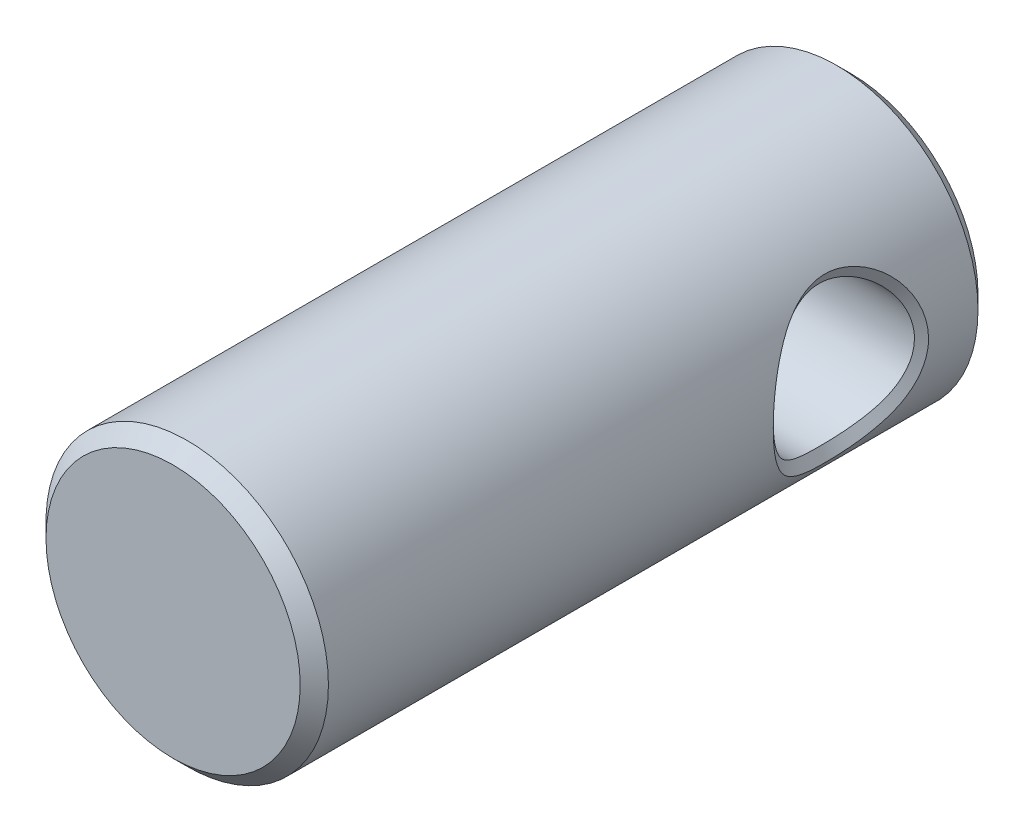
ISO-10303-21;
HEADER;
FILE_DESCRIPTION(('STEP AP214'),'2;1');
FILE_NAME('part.step','',(''),(''),'','','');
FILE_SCHEMA(('AUTOMOTIVE_DESIGN { 1 0 10303 214 1 1 1 1 }'));
ENDSEC;
DATA;
#1=APPLICATION_CONTEXT('core data for automotive mechanical design processes');
#2=APPLICATION_PROTOCOL_DEFINITION('international standard','automotive_design',2000,#1);
#3=PRODUCT_CONTEXT('',#1,'mechanical');
#4=PRODUCT('Part','Part','',(#3));
#5=PRODUCT_RELATED_PRODUCT_CATEGORY('part','',(#4));
#6=PRODUCT_DEFINITION_FORMATION('','',#4);
#7=PRODUCT_DEFINITION_CONTEXT('part definition',#1,'design');
#8=PRODUCT_DEFINITION('design','',#6,#7);
#9=PRODUCT_DEFINITION_SHAPE('','',#8);
#10=(LENGTH_UNIT() NAMED_UNIT(*) SI_UNIT(.MILLI.,.METRE.));
#11=(NAMED_UNIT(*) PLANE_ANGLE_UNIT() SI_UNIT($,.RADIAN.));
#12=(NAMED_UNIT(*) SI_UNIT($,.STERADIAN.) SOLID_ANGLE_UNIT());
#13=UNCERTAINTY_MEASURE_WITH_UNIT(LENGTH_MEASURE(1.E-05),#10,'distance_accuracy_value','');
#14=(GEOMETRIC_REPRESENTATION_CONTEXT(3) GLOBAL_UNCERTAINTY_ASSIGNED_CONTEXT((#13)) GLOBAL_UNIT_ASSIGNED_CONTEXT((#10,
#11,#12)) REPRESENTATION_CONTEXT('',''));
#15=CARTESIAN_POINT('',(0.,0.,0.));
#16=DIRECTION('',(0.,0.,1.));
#17=DIRECTION('',(1.,0.,0.));
#18=AXIS2_PLACEMENT_3D('',#15,#16,#17);
#19=CARTESIAN_POINT('',(0.,0.,48.));
#20=DIRECTION('',(0.,0.,-1.));
#21=DIRECTION('',(-1.,0.,0.));
#22=AXIS2_PLACEMENT_3D('',#19,#20,#21);
#23=CYLINDRICAL_SURFACE('',#22,10.);
#24=CARTESIAN_POINT('',(-10.,0.,15.499995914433));
#25=CARTESIAN_POINT('',(-10.0000070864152,0.0974069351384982,15.5000148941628));
#26=CARTESIAN_POINT('',(-9.99843697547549,0.194806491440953,15.4976010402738));
#27=CARTESIAN_POINT('',(-9.99229133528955,0.38888267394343,15.4880078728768));
#28=CARTESIAN_POINT('',(-9.98772794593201,0.485560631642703,15.4808478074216));
#29=CARTESIAN_POINT('',(-9.97575963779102,0.678000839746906,15.4618882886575));
#30=CARTESIAN_POINT('',(-9.9683628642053,0.773764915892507,15.450102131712));
#31=CARTESIAN_POINT('',(-9.95089545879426,0.964191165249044,15.4220219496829));
#32=CARTESIAN_POINT('',(-9.94083002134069,1.05885511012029,15.4057366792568));
#33=CARTESIAN_POINT('',(-9.91819059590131,1.24689378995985,15.3687864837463));
#34=CARTESIAN_POINT('',(-9.90561976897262,1.34026999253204,15.3481270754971));
#35=CARTESIAN_POINT('',(-9.87813433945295,1.52554646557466,15.3025560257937));
#36=CARTESIAN_POINT('',(-9.86322161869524,1.61744785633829,15.2776477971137));
#37=CARTESIAN_POINT('',(-9.83121636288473,1.79958784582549,15.2237052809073));
#38=CARTESIAN_POINT('',(-9.81412502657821,1.88982732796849,15.1946732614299));
#39=CARTESIAN_POINT('',(-9.77792596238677,2.06845650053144,15.1326084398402));
#40=CARTESIAN_POINT('',(-9.75881919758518,2.15684705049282,15.0995775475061));
#41=CARTESIAN_POINT('',(-9.71875228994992,2.33159109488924,15.0296394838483));
#42=CARTESIAN_POINT('',(-9.69779318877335,2.41794570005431,14.992734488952));
#43=CARTESIAN_POINT('',(-9.6541842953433,2.58843026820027,14.9151721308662));
#44=CARTESIAN_POINT('',(-9.63153582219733,2.67256189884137,14.874517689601));
#45=CARTESIAN_POINT('',(-9.58471085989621,2.83841264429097,14.7895798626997));
#46=CARTESIAN_POINT('',(-9.56053606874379,2.9201342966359,14.7453004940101));
#47=CARTESIAN_POINT('',(-9.51082045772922,3.08097669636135,14.6532359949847));
#48=CARTESIAN_POINT('',(-9.48528173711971,3.16010115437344,14.6054562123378));
#49=CARTESIAN_POINT('',(-9.43300250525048,3.31556112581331,14.506513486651));
#50=CARTESIAN_POINT('',(-9.4062644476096,3.39190180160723,14.4553573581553));
#51=CARTESIAN_POINT('',(-9.35174243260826,3.54160338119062,14.3497857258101));
#52=CARTESIAN_POINT('',(-9.32396120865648,3.61497115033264,14.2953785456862));
#53=CARTESIAN_POINT('',(-9.26754009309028,3.75854510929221,14.1834236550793));
#54=CARTESIAN_POINT('',(-9.23890299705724,3.82876004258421,14.1258857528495));
#55=CARTESIAN_POINT('',(-9.1808414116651,3.96581184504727,14.0078064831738));
#56=CARTESIAN_POINT('',(-9.15141999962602,4.03265959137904,13.9472762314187));
#57=CARTESIAN_POINT('',(-9.09221678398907,4.16305469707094,13.8231235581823));
#58=CARTESIAN_POINT('',(-9.06243553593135,4.22660649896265,13.7595055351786));
#59=CARTESIAN_POINT('',(-9.00302799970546,4.35056812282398,13.6291413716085));
#60=CARTESIAN_POINT('',(-8.97340179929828,4.41097630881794,13.5623936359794));
#61=CARTESIAN_POINT('',(-8.9144674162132,4.52849089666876,13.425949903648));
#62=CARTESIAN_POINT('',(-8.88515915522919,4.58559812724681,13.3562546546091));
#63=CARTESIAN_POINT('',(-8.8271391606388,4.69638539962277,13.2140773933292));
#64=CARTESIAN_POINT('',(-8.7984268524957,4.750068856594,13.1415982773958));
#65=CARTESIAN_POINT('',(-8.74184676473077,4.85387377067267,12.9940199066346));
#66=CARTESIAN_POINT('',(-8.71397760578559,4.9040012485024,12.9189254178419));
#67=CARTESIAN_POINT('',(-8.65934041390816,5.00056185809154,12.7662818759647));
#68=CARTESIAN_POINT('',(-8.63256991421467,5.04700351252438,12.688739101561));
#69=CARTESIAN_POINT('',(-8.58038468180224,5.13605957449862,12.5313652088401));
#70=CARTESIAN_POINT('',(-8.55496621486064,5.17868477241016,12.4515414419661));
#71=CARTESIAN_POINT('',(-8.5057404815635,5.25997539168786,12.289772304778));
#72=CARTESIAN_POINT('',(-8.48192815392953,5.29865346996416,12.2078348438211));
#73=CARTESIAN_POINT('',(-8.43616989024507,5.3719178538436,12.0420048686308));
#74=CARTESIAN_POINT('',(-8.4142176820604,5.40651807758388,11.9581202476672));
#75=CARTESIAN_POINT('',(-8.37243517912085,5.47149476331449,11.7885657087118));
#76=CARTESIAN_POINT('',(-8.35259774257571,5.50188555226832,11.7029030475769));
#77=CARTESIAN_POINT('',(-8.31529826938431,5.55831460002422,11.5299529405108));
#78=CARTESIAN_POINT('',(-8.29782885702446,5.58436643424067,11.4426715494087));
#79=CARTESIAN_POINT('',(-8.27358485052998,5.62010055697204,11.3105942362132));
#80=CARTESIAN_POINT('',(-8.26583673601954,5.63144531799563,11.2664191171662));
#81=CARTESIAN_POINT('',(-8.25102870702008,5.65299982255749,11.1777280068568));
#82=CARTESIAN_POINT('',(-8.24396806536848,5.66321076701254,11.133212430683));
#83=CARTESIAN_POINT('',(-8.23056696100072,5.68248103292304,11.0438631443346));
#84=CARTESIAN_POINT('',(-8.22422592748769,5.69154126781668,10.9990297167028));
#85=CARTESIAN_POINT('',(-8.21229553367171,5.70849424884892,10.9090654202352));
#86=CARTESIAN_POINT('',(-8.20670581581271,5.71638755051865,10.8639347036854));
#87=CARTESIAN_POINT('',(-8.19630960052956,5.73099069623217,10.7733970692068));
#88=CARTESIAN_POINT('',(-8.19150302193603,5.73770066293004,10.7279901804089));
#89=CARTESIAN_POINT('',(-8.18270455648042,5.74992126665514,10.6369212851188));
#90=CARTESIAN_POINT('',(-8.17871293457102,5.75543151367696,10.5912592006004));
#91=CARTESIAN_POINT('',(-8.17157571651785,5.76523697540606,10.4997010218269));
#92=CARTESIAN_POINT('',(-8.16843080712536,5.76953120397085,10.4538047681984));
#93=CARTESIAN_POINT('',(-8.16301854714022,5.7768886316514,10.3617993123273));
#94=CARTESIAN_POINT('',(-8.16075238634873,5.77995016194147,10.3156899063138));
#95=CARTESIAN_POINT('',(-8.15712803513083,5.78482770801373,10.2232792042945));
#96=CARTESIAN_POINT('',(-8.15577162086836,5.78664128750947,10.1769777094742));
#97=CARTESIAN_POINT('',(-8.15400098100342,5.78900319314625,10.084203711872));
#98=CARTESIAN_POINT('',(-8.15358921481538,5.7895482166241,10.0377310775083));
#99=CARTESIAN_POINT('',(-8.15372716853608,5.78937368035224,9.94480553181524));
#100=CARTESIAN_POINT('',(-8.15427656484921,5.78865454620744,9.89835261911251));
#101=CARTESIAN_POINT('',(-8.15630034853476,5.78597468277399,9.8056549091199));
#102=CARTESIAN_POINT('',(-8.15777171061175,5.78401801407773,9.75940992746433));
#103=CARTESIAN_POINT('',(-8.16161088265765,5.77887481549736,9.66714665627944));
#104=CARTESIAN_POINT('',(-8.16397635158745,5.77569149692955,9.62112808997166));
#105=CARTESIAN_POINT('',(-8.169571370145,5.76811202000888,9.52933614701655));
#106=CARTESIAN_POINT('',(-8.17279919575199,5.76371828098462,9.48356246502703));
#107=CARTESIAN_POINT('',(-8.18008768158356,5.75373347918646,9.39227872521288));
#108=CARTESIAN_POINT('',(-8.18414715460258,5.74814412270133,9.34676838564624));
#109=CARTESIAN_POINT('',(-8.1930674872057,5.73578390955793,9.25602972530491));
#110=CARTESIAN_POINT('',(-8.1979276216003,5.72901412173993,9.21080118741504));
#111=CARTESIAN_POINT('',(-8.20841798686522,5.71430867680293,9.12064444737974));
#112=CARTESIAN_POINT('',(-8.21404788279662,5.7063735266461,9.07571612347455));
#113=CARTESIAN_POINT('',(-8.22604650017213,5.68935298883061,8.98617824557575));
#114=CARTESIAN_POINT('',(-8.23241520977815,5.68026761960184,8.94156868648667));
#115=CARTESIAN_POINT('',(-8.24586037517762,5.66096200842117,8.8526862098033));
#116=CARTESIAN_POINT('',(-8.25293708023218,5.65074136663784,8.80841341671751));
#117=CARTESIAN_POINT('',(-8.26776676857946,5.62918120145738,8.72022436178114));
#118=CARTESIAN_POINT('',(-8.27552020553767,5.61784092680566,8.67630836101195));
#119=CARTESIAN_POINT('',(-8.29976211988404,5.58214440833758,8.54504975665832));
#120=CARTESIAN_POINT('',(-8.31721256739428,5.55614049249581,8.45832523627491));
#121=CARTESIAN_POINT('',(-8.35444324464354,5.49984615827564,8.28652429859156));
#122=CARTESIAN_POINT('',(-8.37422973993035,5.46954416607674,8.20145306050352));
#123=CARTESIAN_POINT('',(-8.41588584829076,5.40477494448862,8.03309606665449));
#124=CARTESIAN_POINT('',(-8.43776209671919,5.37029434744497,7.94981710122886));
#125=CARTESIAN_POINT('',(-8.48335043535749,5.29728998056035,7.78519214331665));
#126=CARTESIAN_POINT('',(-8.50706877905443,5.25875226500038,7.70385408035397));
#127=CARTESIAN_POINT('',(-8.55609515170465,5.17775398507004,7.54325638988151));
#128=CARTESIAN_POINT('',(-8.5814085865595,5.13527982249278,7.46400528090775));
#129=CARTESIAN_POINT('',(-8.63337911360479,5.04652820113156,7.307728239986));
#130=CARTESIAN_POINT('',(-8.66004052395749,5.00023817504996,7.2307108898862));
#131=CARTESIAN_POINT('',(-8.71446173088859,4.90397392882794,7.07904849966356));
#132=CARTESIAN_POINT('',(-8.74222469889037,4.85398865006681,7.00441162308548));
#133=CARTESIAN_POINT('',(-8.79860168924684,4.75045169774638,6.8576577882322));
#134=CARTESIAN_POINT('',(-8.82721780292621,4.69689077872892,6.78554816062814));
#135=CARTESIAN_POINT('',(-8.88506137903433,4.58632332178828,6.64399713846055));
#136=CARTESIAN_POINT('',(-8.91429003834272,4.52930952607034,6.57456190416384));
#137=CARTESIAN_POINT('',(-8.97308984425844,4.4119447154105,6.43850724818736));
#138=CARTESIAN_POINT('',(-9.00266146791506,4.35158845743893,6.37189255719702));
#139=CARTESIAN_POINT('',(-9.06198646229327,4.22769281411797,6.24163090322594));
#140=CARTESIAN_POINT('',(-9.09173998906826,4.16415020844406,6.17798707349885));
#141=CARTESIAN_POINT('',(-9.15091370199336,4.03375252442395,6.05369678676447));
#142=CARTESIAN_POINT('',(-9.18033301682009,3.96689050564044,5.99305718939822));
#143=CARTESIAN_POINT('',(-9.23840609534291,3.82980320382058,5.87477571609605));
#144=CARTESIAN_POINT('',(-9.26705687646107,3.7595671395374,5.81714487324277));
#145=CARTESIAN_POINT('',(-9.32351390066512,3.61594804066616,5.7050096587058));
#146=CARTESIAN_POINT('',(-9.35131738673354,3.54255628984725,5.65051506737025));
#147=CARTESIAN_POINT('',(-9.40589156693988,3.3927970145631,5.5447779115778));
#148=CARTESIAN_POINT('',(-9.43265952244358,3.31642254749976,5.49354376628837));
#149=CARTESIAN_POINT('',(-9.48500362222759,3.16088135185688,5.39445406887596));
#150=CARTESIAN_POINT('',(-9.51057724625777,3.08170928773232,5.34660556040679));
#151=CARTESIAN_POINT('',(-9.56036563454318,2.92075333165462,5.2544134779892));
#152=CARTESIAN_POINT('',(-9.58457815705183,2.83896546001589,5.21007563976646));
#153=CARTESIAN_POINT('',(-9.6314793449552,2.67295944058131,5.12503123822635));
#154=CARTESIAN_POINT('',(-9.65416607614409,2.58873839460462,5.08432926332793));
#155=CARTESIAN_POINT('',(-9.6978500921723,2.41804760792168,5.0066827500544));
#156=CARTESIAN_POINT('',(-9.71884570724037,2.33157575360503,4.96974191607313));
#157=CARTESIAN_POINT('',(-9.75898210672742,2.15656528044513,4.89974358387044));
#158=CARTESIAN_POINT('',(-9.77812136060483,2.06802502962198,4.8666892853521));
#159=CARTESIAN_POINT('',(-9.81437974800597,1.8890599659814,4.80458953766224));
#160=CARTESIAN_POINT('',(-9.83149726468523,1.79863371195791,4.77554729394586));
#161=CARTESIAN_POINT('',(-9.8635471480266,1.61607912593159,4.72159664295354));
#162=CARTESIAN_POINT('',(-9.87847746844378,1.5239492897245,4.69669210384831));
#163=CARTESIAN_POINT('',(-9.90598826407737,1.3381702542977,4.65114120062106));
#164=CARTESIAN_POINT('',(-9.91856578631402,1.2445193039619,4.63050018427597));
#165=CARTESIAN_POINT('',(-9.94120689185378,1.0558809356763,4.59359974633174));
#166=CARTESIAN_POINT('',(-9.95126599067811,0.96089144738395,4.57734813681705));
#167=CARTESIAN_POINT('',(-9.96870643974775,0.769758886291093,4.54934924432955));
#168=CARTESIAN_POINT('',(-9.97608099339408,0.67361351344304,4.53761338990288));
#169=CARTESIAN_POINT('',(-9.98799073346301,0.480352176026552,4.51876638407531));
#170=CARTESIAN_POINT('',(-9.99251588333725,0.383233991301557,4.51167157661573));
#171=CARTESIAN_POINT('',(-9.99856097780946,0.188208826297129,4.50223016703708));
#172=CARTESIAN_POINT('',(-10.000066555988,0.0903002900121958,4.49990626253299));
#173=CARTESIAN_POINT('',(-9.99992768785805,-0.105471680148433,4.50011135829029));
#174=CARTESIAN_POINT('',(-9.99828444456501,-0.203335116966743,4.50263850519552));
#175=CARTESIAN_POINT('',(-9.99199182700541,-0.398188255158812,4.51246220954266));
#176=CARTESIAN_POINT('',(-9.98735886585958,-0.495179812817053,4.51973272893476));
#177=CARTESIAN_POINT('',(-9.97525178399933,-0.68811629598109,4.53891346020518));
#178=CARTESIAN_POINT('',(-9.96778948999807,-0.784063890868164,4.55080436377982));
#179=CARTESIAN_POINT('',(-9.95019270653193,-0.974739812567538,4.57909322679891));
#180=CARTESIAN_POINT('',(-9.94006648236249,-1.06947097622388,4.59547725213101));
#181=CARTESIAN_POINT('',(-9.9173083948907,-1.25754213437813,4.63262228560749));
#182=CARTESIAN_POINT('',(-9.90468217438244,-1.35088476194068,4.65337344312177));
#183=CARTESIAN_POINT('',(-9.87709009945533,-1.53600719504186,4.6991236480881));
#184=CARTESIAN_POINT('',(-9.86212806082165,-1.62778928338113,4.72411577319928));
#185=CARTESIAN_POINT('',(-9.83002949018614,-1.80961907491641,4.77822004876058));
#186=CARTESIAN_POINT('',(-9.81289559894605,-1.89966873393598,4.80732720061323));
#187=CARTESIAN_POINT('',(-9.77661786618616,-2.07786201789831,4.86953462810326));
#188=CARTESIAN_POINT('',(-9.75747600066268,-2.16600741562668,4.90263098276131));
#189=CARTESIAN_POINT('',(-9.71734638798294,-2.3402203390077,4.97269074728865));
#190=CARTESIAN_POINT('',(-9.69636033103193,-2.42628967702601,5.00965062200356));
#191=CARTESIAN_POINT('',(-9.65270601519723,-2.59617837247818,5.087312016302));
#192=CARTESIAN_POINT('',(-9.63003942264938,-2.67999984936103,5.12800983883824));
#193=CARTESIAN_POINT('',(-9.58318763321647,-2.84522044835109,5.21302228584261));
#194=CARTESIAN_POINT('',(-9.55900423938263,-2.92662228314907,5.25733263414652));
#195=CARTESIAN_POINT('',(-9.50928173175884,-3.08683079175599,5.3494455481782));
#196=CARTESIAN_POINT('',(-9.48374463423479,-3.16564105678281,5.39724295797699));
#197=CARTESIAN_POINT('',(-9.4314796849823,-3.32049376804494,5.4962062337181));
#198=CARTESIAN_POINT('',(-9.40475406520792,-3.39654095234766,5.54736586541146));
#199=CARTESIAN_POINT('',(-9.35026908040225,-3.54569287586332,5.65292802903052));
#200=CARTESIAN_POINT('',(-9.32251212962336,-3.61880374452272,5.70732314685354));
#201=CARTESIAN_POINT('',(-9.26615117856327,-3.76191442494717,5.8192382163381));
#202=CARTESIAN_POINT('',(-9.23754960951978,-3.83192194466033,5.87674953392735));
#203=CARTESIAN_POINT('',(-9.17957606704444,-3.96863380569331,5.99475149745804));
#204=CARTESIAN_POINT('',(-9.15020673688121,-4.03534765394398,6.05523242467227));
#205=CARTESIAN_POINT('',(-9.09111734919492,-4.16551258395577,6.17926932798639));
#206=CARTESIAN_POINT('',(-9.06139777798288,-4.22896765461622,6.24282135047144));
#207=CARTESIAN_POINT('',(-9.0021136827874,-4.35272120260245,6.37304683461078));
#208=CARTESIAN_POINT('',(-8.97254922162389,-4.41301847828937,6.43972146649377));
#209=CARTESIAN_POINT('',(-8.91374114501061,-4.53030858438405,6.57600613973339));
#210=CARTESIAN_POINT('',(-8.88449741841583,-4.5873025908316,6.64561512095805));
#211=CARTESIAN_POINT('',(-8.82660636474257,-4.69786134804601,6.78760978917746));
#212=CARTESIAN_POINT('',(-8.79795842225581,-4.7514297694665,6.85999236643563));
#213=CARTESIAN_POINT('',(-8.74150549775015,-4.8550061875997,7.00736800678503));
#214=CARTESIAN_POINT('',(-8.71369910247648,-4.90502036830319,7.08235618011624));
#215=CARTESIAN_POINT('',(-8.65918400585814,-5.00135878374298,7.23477849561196));
#216=CARTESIAN_POINT('',(-8.63247282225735,-5.04769161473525,7.31220631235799));
#217=CARTESIAN_POINT('',(-8.58040102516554,-5.13653747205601,7.46934259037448));
#218=CARTESIAN_POINT('',(-8.55503668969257,-5.17906127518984,7.54904371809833));
#219=CARTESIAN_POINT('',(-8.50591221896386,-5.26015952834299,7.71056083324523));
#220=CARTESIAN_POINT('',(-8.48214706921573,-5.29874654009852,7.79236897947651));
#221=CARTESIAN_POINT('',(-8.43647436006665,-5.37184220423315,7.9579345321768));
#222=CARTESIAN_POINT('',(-8.41456061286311,-5.40636460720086,8.04168414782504));
#223=CARTESIAN_POINT('',(-8.37284442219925,-5.47120204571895,8.21096387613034));
#224=CARTESIAN_POINT('',(-8.35303495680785,-5.50153118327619,8.29648685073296));
#225=CARTESIAN_POINT('',(-8.31577902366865,-5.55785626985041,8.46915370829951));
#226=CARTESIAN_POINT('',(-8.29832532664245,-5.58386553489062,8.55629165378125));
#227=CARTESIAN_POINT('',(-8.27409451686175,-5.61955210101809,8.68815013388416));
#228=CARTESIAN_POINT('',(-8.26634895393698,-5.6308839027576,8.73225256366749));
#229=CARTESIAN_POINT('',(-8.25154227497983,-5.6524183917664,8.82079774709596));
#230=CARTESIAN_POINT('',(-8.24448045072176,-5.66262224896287,8.86524009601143));
#231=CARTESIAN_POINT('',(-8.23107300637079,-5.68188460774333,8.95444251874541));
#232=CARTESIAN_POINT('',(-8.2247268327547,-5.69094399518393,8.99920231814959));
#233=CARTESIAN_POINT('',(-8.21278196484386,-5.70790190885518,9.08901907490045));
#234=CARTESIAN_POINT('',(-8.20718292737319,-5.7158009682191,9.13407588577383));
#235=CARTESIAN_POINT('',(-8.19676366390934,-5.73042260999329,9.224465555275));
#236=CARTESIAN_POINT('',(-8.19194336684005,-5.73714529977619,9.26979838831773));
#237=CARTESIAN_POINT('',(-8.18311282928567,-5.74939870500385,9.36071914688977));
#238=CARTESIAN_POINT('',(-8.17910285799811,-5.75492902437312,9.40630715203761));
#239=CARTESIAN_POINT('',(-8.17192412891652,-5.76478226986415,9.49771727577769));
#240=CARTESIAN_POINT('',(-8.16875605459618,-5.76910421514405,9.54353955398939));
#241=CARTESIAN_POINT('',(-8.163292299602,-5.77652532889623,9.63539728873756));
#242=CARTESIAN_POINT('',(-8.16099779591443,-5.77962284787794,9.68143294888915));
#243=CARTESIAN_POINT('',(-8.15731190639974,-5.78457999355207,9.77369652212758));
#244=CARTESIAN_POINT('',(-8.15592227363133,-5.7864372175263,9.81992463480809));
#245=CARTESIAN_POINT('',(-8.15407817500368,-5.78889804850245,9.91255233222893));
#246=CARTESIAN_POINT('',(-8.153626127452,-5.78949841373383,9.95895205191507));
#247=CARTESIAN_POINT('',(-8.15368378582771,-5.78943259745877,10.051742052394));
#248=CARTESIAN_POINT('',(-8.15419332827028,-5.78876663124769,10.0981323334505));
#249=CARTESIAN_POINT('',(-8.15614446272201,-5.78617857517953,10.1907232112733));
#250=CARTESIAN_POINT('',(-8.15758334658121,-5.78426013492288,10.2369239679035));
#251=CARTESIAN_POINT('',(-8.16136228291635,-5.77918352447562,10.3291159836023));
#252=CARTESIAN_POINT('',(-8.16370030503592,-5.77602814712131,10.3751074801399));
#253=CARTESIAN_POINT('',(-8.16924531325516,-5.76849466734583,10.4668611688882));
#254=CARTESIAN_POINT('',(-8.17245086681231,-5.76411858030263,10.5126236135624));
#255=CARTESIAN_POINT('',(-8.17969919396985,-5.75416041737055,10.6038994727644));
#256=CARTESIAN_POINT('',(-8.18374105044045,-5.74857966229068,10.6494131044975));
#257=CARTESIAN_POINT('',(-8.19263021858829,-5.7362288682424,10.7401716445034));
#258=CARTESIAN_POINT('',(-8.1974770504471,-5.72945953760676,10.7854166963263));
#259=CARTESIAN_POINT('',(-8.20794451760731,-5.71474818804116,10.8756184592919));
#260=CARTESIAN_POINT('',(-8.21356503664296,-5.70680634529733,10.9205752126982));
#261=CARTESIAN_POINT('',(-8.22554826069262,-5.68976653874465,11.0101806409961));
#262=CARTESIAN_POINT('',(-8.23191114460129,-5.6806682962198,11.0548292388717));
#263=CARTESIAN_POINT('',(-8.2453476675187,-5.66133199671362,11.1437991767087));
#264=CARTESIAN_POINT('',(-8.25242171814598,-5.65109327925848,11.1881203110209));
#265=CARTESIAN_POINT('',(-8.26724876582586,-5.62949294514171,11.2764141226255));
#266=CARTESIAN_POINT('',(-8.27500235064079,-5.61813035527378,11.3203864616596));
#267=CARTESIAN_POINT('',(-8.29924987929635,-5.58235973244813,11.4518336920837));
#268=CARTESIAN_POINT('',(-8.31670782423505,-5.55630142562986,11.5386893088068));
#269=CARTESIAN_POINT('',(-8.35395950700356,-5.49989423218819,11.7107691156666));
#270=CARTESIAN_POINT('',(-8.37375995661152,-5.46953296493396,11.7959877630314));
#271=CARTESIAN_POINT('',(-8.41544737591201,-5.40464821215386,11.9646456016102));
#272=CARTESIAN_POINT('',(-8.43734108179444,-5.37011118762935,12.0480779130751));
#273=CARTESIAN_POINT('',(-8.48296504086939,-5.29700413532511,12.2130048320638));
#274=CARTESIAN_POINT('',(-8.506701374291,-5.25842059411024,12.2944917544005));
#275=CARTESIAN_POINT('',(-8.55576166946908,-5.17734801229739,12.4553716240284));
#276=CARTESIAN_POINT('',(-8.58109066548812,-5.13484636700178,12.5347566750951));
#277=CARTESIAN_POINT('',(-8.63308740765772,-5.04606435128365,12.6912752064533));
#278=CARTESIAN_POINT('',(-8.65975897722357,-4.99977292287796,12.7684011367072));
#279=CARTESIAN_POINT('',(-8.71419270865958,-4.90353772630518,12.9202434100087));
#280=CARTESIAN_POINT('',(-8.74195749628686,-4.85358488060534,12.9949530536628));
#281=CARTESIAN_POINT('',(-8.79832723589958,-4.75015190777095,13.1418042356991));
#282=CARTESIAN_POINT('',(-8.82693375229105,-4.69666494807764,13.2139403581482));
#283=CARTESIAN_POINT('',(-8.88474459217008,-4.58629206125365,13.3554852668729));
#284=CARTESIAN_POINT('',(-8.913949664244,-4.52940168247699,13.4248902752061));
#285=CARTESIAN_POINT('',(-8.97268416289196,-4.41233703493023,13.560814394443));
#286=CARTESIAN_POINT('',(-9.00221378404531,-4.3521606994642,13.6273316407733));
#287=CARTESIAN_POINT('',(-9.06143884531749,-4.22868820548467,13.757317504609));
#288=CARTESIAN_POINT('',(-9.09113427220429,-4.16539229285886,13.8207863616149));
#289=CARTESIAN_POINT('',(-9.15018665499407,-4.03547567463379,13.9447046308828));
#290=CARTESIAN_POINT('',(-9.17954277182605,-3.96884828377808,14.0051474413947));
#291=CARTESIAN_POINT('',(-9.23749927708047,-3.83215587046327,14.123085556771));
#292=CARTESIAN_POINT('',(-9.26609578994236,-3.76207706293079,14.1805667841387));
#293=CARTESIAN_POINT('',(-9.32245881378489,-3.61871316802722,14.292449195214));
#294=CARTESIAN_POINT('',(-9.35022177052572,-3.54541694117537,14.3468378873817));
#295=CARTESIAN_POINT('',(-9.40472743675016,-3.39580137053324,14.4524055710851));
#296=CARTESIAN_POINT('',(-9.43146662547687,-3.31947316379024,14.5035738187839));
#297=CARTESIAN_POINT('',(-9.48376553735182,-3.16398999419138,14.6025699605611));
#298=CARTESIAN_POINT('',(-9.50932204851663,-3.08482826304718,14.650388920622));
#299=CARTESIAN_POINT('',(-9.55908780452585,-2.92387111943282,14.7425559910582));
#300=CARTESIAN_POINT('',(-9.58329424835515,-2.84207074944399,14.7868969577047));
#301=CARTESIAN_POINT('',(-9.63019420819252,-2.6760306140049,14.8719775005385));
#302=CARTESIAN_POINT('',(-9.65288541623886,-2.59178739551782,14.9127116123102));
#303=CARTESIAN_POINT('',(-9.69658856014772,-2.42105589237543,14.9904480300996));
#304=CARTESIAN_POINT('',(-9.71759869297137,-2.33456532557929,15.0274463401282));
#305=CARTESIAN_POINT('',(-9.75777349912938,-2.15953384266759,15.0975809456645));
#306=CARTESIAN_POINT('',(-9.77693680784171,-2.07099146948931,15.1307143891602));
#307=CARTESIAN_POINT('',(-9.81325181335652,-1.892051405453,15.192989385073));
#308=CARTESIAN_POINT('',(-9.83040241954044,-1.80165273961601,15.2221287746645));
#309=CARTESIAN_POINT('',(-9.86252605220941,-1.61919544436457,15.2762862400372));
#310=CARTESIAN_POINT('',(-9.87749798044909,-1.52713600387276,15.3013022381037));
#311=CARTESIAN_POINT('',(-9.90509861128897,-1.34155284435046,15.3470841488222));
#312=CARTESIAN_POINT('',(-9.91772578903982,-1.24802821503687,15.3678472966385));
#313=CARTESIAN_POINT('',(-9.94047162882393,-1.05971048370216,15.4049953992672));
#314=CARTESIAN_POINT('',(-9.95058776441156,-0.964916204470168,15.4213759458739));
#315=CARTESIAN_POINT('',(-9.96814716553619,-0.774255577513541,15.449632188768));
#316=CARTESIAN_POINT('',(-9.97558615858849,-0.678387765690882,15.4615006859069));
#317=CARTESIAN_POINT('',(-9.98762645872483,-0.485774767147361,15.4806055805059));
#318=CARTESIAN_POINT('',(-9.99222082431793,-0.389028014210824,15.4878306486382));
#319=CARTESIAN_POINT('',(-9.99841265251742,-0.194857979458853,15.4975294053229));
#320=CARTESIAN_POINT('',(-9.99999943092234,-0.0974335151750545,15.4999861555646));
#321=CARTESIAN_POINT('',(-10.,0.,15.499995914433));
#322=B_SPLINE_CURVE_WITH_KNOTS('',3,(#24,#25,#26,#27,#28,#29,#30,#31,#32,#33,#34,#35,#36,#37,
#38,#39,#40,#41,#42,#43,#44,#45,#46,#47,#48,#49,#50,#51,#52,#53,#54,#55,#56,#57,#58,#59,#60,#61,
#62,#63,#64,#65,#66,#67,#68,#69,#70,#71,#72,#73,#74,#75,#76,#77,#78,#79,#80,#81,#82,#83,#84,#85,
#86,#87,#88,#89,#90,#91,#92,#93,#94,#95,#96,#97,#98,#99,#100,#101,#102,#103,#104,#105,#106,#107,
#108,#109,#110,#111,#112,#113,#114,#115,#116,#117,#118,#119,#120,#121,#122,#123,#124,#125,#126,
#127,#128,#129,#130,#131,#132,#133,#134,#135,#136,#137,#138,#139,#140,#141,#142,#143,#144,#145,
#146,#147,#148,#149,#150,#151,#152,#153,#154,#155,#156,#157,#158,#159,#160,#161,#162,#163,#164,
#165,#166,#167,#168,#169,#170,#171,#172,#173,#174,#175,#176,#177,#178,#179,#180,#181,#182,#183,
#184,#185,#186,#187,#188,#189,#190,#191,#192,#193,#194,#195,#196,#197,#198,#199,#200,#201,#202,
#203,#204,#205,#206,#207,#208,#209,#210,#211,#212,#213,#214,#215,#216,#217,#218,#219,#220,#221,
#222,#223,#224,#225,#226,#227,#228,#229,#230,#231,#232,#233,#234,#235,#236,#237,#238,#239,#240,
#241,#242,#243,#244,#245,#246,#247,#248,#249,#250,#251,#252,#253,#254,#255,#256,#257,#258,#259,
#260,#261,#262,#263,#264,#265,#266,#267,#268,#269,#270,#271,#272,#273,#274,#275,#276,#277,#278,
#279,#280,#281,#282,#283,#284,#285,#286,#287,#288,#289,#290,#291,#292,#293,#294,#295,#296,#297,
#298,#299,#300,#301,#302,#303,#304,#305,#306,#307,#308,#309,#310,#311,#312,#313,#314,#315,#316,
#317,#318,#319,#320,#321),.UNSPECIFIED.,.F.,.F.,(4,2,2,2,2,2,2,2,2,2,2,2,2,2,2,2,2,2,2,2,2,2,2,
2,2,2,2,2,2,2,2,2,2,2,2,2,2,2,2,2,2,2,2,2,2,2,2,2,2,2,2,2,2,2,2,2,2,2,2,2,2,2,2,2,2,2,2,2,2,2,2,
2,2,2,2,2,2,2,2,2,2,2,2,2,2,2,2,2,2,2,2,2,2,2,2,2,2,2,2,2,2,2,2,2,2,2,2,2,2,2,2,2,2,2,2,2,2,2,2,
2,2,2,2,2,2,2,2,2,2,2,2,2,2,2,2,2,2,2,2,2,2,2,2,2,2,2,2,2,4),(0.,0.292166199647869,
0.583154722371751,0.873312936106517,1.16291047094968,1.45214490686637,1.74114810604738,
2.02999296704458,2.31870042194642,2.60724654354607,2.89556967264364,3.18357751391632,
3.47115418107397,3.75816719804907,4.04447448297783,4.32993135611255,4.6143976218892,
4.89846992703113,5.18268861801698,5.46683564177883,5.75069465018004,6.03406097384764,
6.31675173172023,6.59861617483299,6.87954633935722,7.15948804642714,7.43845223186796,
7.71652651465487,7.85529605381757,7.99391717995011,8.13242757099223,8.27087180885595,
8.40930168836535,8.54777650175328,8.68636329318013,8.82513707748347,8.96418101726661,
9.10358655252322,9.24294516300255,9.38184886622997,9.52039136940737,9.65865894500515,
9.79673049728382,9.93467767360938,10.0725650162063,10.2104501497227,10.3483839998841,
10.4864110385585,10.7628639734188,11.0400759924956,11.3181994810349,11.597312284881,
11.877428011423,12.1585062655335,12.4404626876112,12.7231787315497,13.0065111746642,
13.2903013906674,13.5743844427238,13.8590887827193,14.1447727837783,14.4313041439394,
14.7185476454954,15.0063721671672,15.294657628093,15.5833019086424,15.8722277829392,
16.1613898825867,16.4507816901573,16.7404425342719,17.0304645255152,17.3209993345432,
17.6122646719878,17.9045502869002,18.1982232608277,18.4917840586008,18.7837468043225,
19.0745023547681,19.3643662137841,19.6535831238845,19.9423324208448,20.2307339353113,
20.5188542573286,20.8067132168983,21.0942904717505,21.3815321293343,21.6683573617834,
21.9546649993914,22.2403401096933,22.5252605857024,22.8093037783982,23.0929905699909,
23.3767845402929,23.6604768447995,23.9438598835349,24.2267371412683,24.5089331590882,
24.7903037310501,25.0707463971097,25.3502112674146,25.6287121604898,25.9063379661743,
26.0448886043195,26.1832941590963,26.3215919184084,26.4598259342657,26.5980473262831,
26.7363145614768,26.8746937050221,27.0132586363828,27.1520912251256,27.2912814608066,
27.430448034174,27.5692108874,27.7076622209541,27.845886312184,27.9839596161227,28.121950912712,
28.2599214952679,28.3979253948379,28.536009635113,28.6742145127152,28.9510876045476,
29.2287741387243,29.5073864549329,29.7869607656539,30.0674681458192,30.3488253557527,
30.6309053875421,30.9135476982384,31.1965681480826,31.4797687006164,31.762946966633,
32.0467182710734,32.3317331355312,32.6178275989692,32.9048307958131,33.1925724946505,
33.4808905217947,33.7696381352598,34.058691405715,34.3479566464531,34.6373779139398,
34.926944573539,35.2166988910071,35.5067435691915,35.7972491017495,36.0884607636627,
36.3807050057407),.UNSPECIFIED.);
#323=CARTESIAN_POINT('',(-10.,0.,15.499995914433));
#324=VERTEX_POINT('',#323);
#325=EDGE_CURVE('E43',#324,#324,#322,.F.);
#326=ORIENTED_EDGE('',*,*,#325,.T.);
#327=EDGE_LOOP('',(#326));
#328=FACE_BOUND('',#327,.T.);
#329=CARTESIAN_POINT('',(10.,0.,4.50000408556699));
#330=CARTESIAN_POINT('',(10.0000070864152,0.0974069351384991,4.49998510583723));
#331=CARTESIAN_POINT('',(9.9984369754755,0.194806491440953,4.50239895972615));
#332=CARTESIAN_POINT('',(9.99229133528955,0.388882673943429,4.5119921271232));
#333=CARTESIAN_POINT('',(9.98772794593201,0.485560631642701,4.51915219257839));
#334=CARTESIAN_POINT('',(9.97575963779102,0.678000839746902,4.53811171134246));
#335=CARTESIAN_POINT('',(9.9683628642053,0.7737649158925,4.54989786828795));
#336=CARTESIAN_POINT('',(9.95089545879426,0.964191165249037,4.57797805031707));
#337=CARTESIAN_POINT('',(9.94083002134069,1.05885511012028,4.59426332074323));
#338=CARTESIAN_POINT('',(9.91819059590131,1.24689378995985,4.63121351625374));
#339=CARTESIAN_POINT('',(9.90561976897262,1.34026999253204,4.65187292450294));
#340=CARTESIAN_POINT('',(9.87813433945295,1.52554646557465,4.69744397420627));
#341=CARTESIAN_POINT('',(9.86322161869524,1.61744785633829,4.72235220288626));
#342=CARTESIAN_POINT('',(9.83121636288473,1.79958784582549,4.77629471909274));
#343=CARTESIAN_POINT('',(9.81412502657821,1.88982732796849,4.80532673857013));
#344=CARTESIAN_POINT('',(9.77792596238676,2.06845650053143,4.86739156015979));
#345=CARTESIAN_POINT('',(9.75881919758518,2.15684705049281,4.90042245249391));
#346=CARTESIAN_POINT('',(9.71875228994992,2.33159109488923,4.9703605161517));
#347=CARTESIAN_POINT('',(9.69779318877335,2.4179457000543,5.00726551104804));
#348=CARTESIAN_POINT('',(9.6541842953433,2.58843026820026,5.0848278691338));
#349=CARTESIAN_POINT('',(9.63153582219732,2.67256189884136,5.12548231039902));
#350=CARTESIAN_POINT('',(9.58471085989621,2.83841264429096,5.21042013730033));
#351=CARTESIAN_POINT('',(9.56053606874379,2.9201342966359,5.25469950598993));
#352=CARTESIAN_POINT('',(9.51082045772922,3.08097669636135,5.34676400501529));
#353=CARTESIAN_POINT('',(9.4852817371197,3.16010115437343,5.3945437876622));
#354=CARTESIAN_POINT('',(9.43300250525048,3.31556112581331,5.49348651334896));
#355=CARTESIAN_POINT('',(9.4062644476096,3.39190180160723,5.54464264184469));
#356=CARTESIAN_POINT('',(9.35174243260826,3.54160338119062,5.65021427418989));
#357=CARTESIAN_POINT('',(9.32396120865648,3.61497115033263,5.70462145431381));
#358=CARTESIAN_POINT('',(9.26754009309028,3.7585451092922,5.81657634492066));
#359=CARTESIAN_POINT('',(9.23890299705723,3.82876004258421,5.87411424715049));
#360=CARTESIAN_POINT('',(9.1808414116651,3.96581184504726,5.99219351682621));
#361=CARTESIAN_POINT('',(9.15141999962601,4.03265959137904,6.0527237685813));
#362=CARTESIAN_POINT('',(9.09221678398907,4.16305469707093,6.17687644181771));
#363=CARTESIAN_POINT('',(9.06243553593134,4.22660649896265,6.24049446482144));
#364=CARTESIAN_POINT('',(9.00302799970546,4.35056812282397,6.37085862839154));
#365=CARTESIAN_POINT('',(8.97340179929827,4.41097630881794,6.43760636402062));
#366=CARTESIAN_POINT('',(8.9144674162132,4.52849089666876,6.57405009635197));
#367=CARTESIAN_POINT('',(8.88515915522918,4.5855981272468,6.64374534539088));
#368=CARTESIAN_POINT('',(8.8271391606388,4.69638539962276,6.7859226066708));
#369=CARTESIAN_POINT('',(8.79842685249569,4.750068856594,6.85840172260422));
#370=CARTESIAN_POINT('',(8.74184676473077,4.85387377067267,7.00598009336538));
#371=CARTESIAN_POINT('',(8.71397760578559,4.9040012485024,7.08107458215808));
#372=CARTESIAN_POINT('',(8.65934041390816,5.00056185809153,7.23371812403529));
#373=CARTESIAN_POINT('',(8.63256991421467,5.04700351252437,7.31126089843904));
#374=CARTESIAN_POINT('',(8.58038468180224,5.13605957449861,7.46863479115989));
#375=CARTESIAN_POINT('',(8.55496621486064,5.17868477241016,7.54845855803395));
#376=CARTESIAN_POINT('',(8.50574048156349,5.25997539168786,7.71022769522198));
#377=CARTESIAN_POINT('',(8.48192815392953,5.29865346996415,7.79216515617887));
#378=CARTESIAN_POINT('',(8.43616989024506,5.37191785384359,7.95799513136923));
#379=CARTESIAN_POINT('',(8.4142176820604,5.40651807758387,8.04187975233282));
#380=CARTESIAN_POINT('',(8.37243517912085,5.47149476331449,8.21143429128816));
#381=CARTESIAN_POINT('',(8.35259774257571,5.50188555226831,8.29709695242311));
#382=CARTESIAN_POINT('',(8.31529826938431,5.55831460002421,8.47004705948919));
#383=CARTESIAN_POINT('',(8.29782885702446,5.58436643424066,8.55732845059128));
#384=CARTESIAN_POINT('',(8.27358485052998,5.62010055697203,8.68940576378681));
#385=CARTESIAN_POINT('',(8.26583673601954,5.63144531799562,8.73358088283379));
#386=CARTESIAN_POINT('',(8.25102870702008,5.65299982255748,8.82227199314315));
#387=CARTESIAN_POINT('',(8.24396806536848,5.66321076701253,8.86678756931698));
#388=CARTESIAN_POINT('',(8.23056696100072,5.68248103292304,8.95613685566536));
#389=CARTESIAN_POINT('',(8.22422592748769,5.69154126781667,9.00097028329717));
#390=CARTESIAN_POINT('',(8.21229553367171,5.70849424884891,9.0909345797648));
#391=CARTESIAN_POINT('',(8.20670581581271,5.71638755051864,9.13606529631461));
#392=CARTESIAN_POINT('',(8.19630960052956,5.73099069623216,9.22660293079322));
#393=CARTESIAN_POINT('',(8.19150302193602,5.73770066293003,9.27200981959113));
#394=CARTESIAN_POINT('',(8.18270455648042,5.74992126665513,9.36307871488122));
#395=CARTESIAN_POINT('',(8.17871293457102,5.75543151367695,9.40874079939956));
#396=CARTESIAN_POINT('',(8.17157571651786,5.76523697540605,9.50029897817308));
#397=CARTESIAN_POINT('',(8.16843080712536,5.76953120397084,9.54619523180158));
#398=CARTESIAN_POINT('',(8.16301854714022,5.7768886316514,9.63820068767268));
#399=CARTESIAN_POINT('',(8.16075238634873,5.77995016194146,9.68431009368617));
#400=CARTESIAN_POINT('',(8.15712803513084,5.78482770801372,9.77672079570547));
#401=CARTESIAN_POINT('',(8.15577162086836,5.78664128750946,9.82302229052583));
#402=CARTESIAN_POINT('',(8.15400098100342,5.78900319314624,9.91579628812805));
#403=CARTESIAN_POINT('',(8.15358921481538,5.78954821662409,9.96226892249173));
#404=CARTESIAN_POINT('',(8.15372716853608,5.78937368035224,10.0551944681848));
#405=CARTESIAN_POINT('',(8.15427656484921,5.78865454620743,10.1016473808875));
#406=CARTESIAN_POINT('',(8.15630034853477,5.78597468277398,10.1943450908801));
#407=CARTESIAN_POINT('',(8.15777171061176,5.78401801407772,10.2405900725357));
#408=CARTESIAN_POINT('',(8.16161088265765,5.77887481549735,10.3328533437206));
#409=CARTESIAN_POINT('',(8.16397635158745,5.77569149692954,10.3788719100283));
#410=CARTESIAN_POINT('',(8.16957137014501,5.76811202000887,10.4706638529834));
#411=CARTESIAN_POINT('',(8.172799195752,5.76371828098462,10.516437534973));
#412=CARTESIAN_POINT('',(8.18008768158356,5.75373347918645,10.6077212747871));
#413=CARTESIAN_POINT('',(8.18414715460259,5.74814412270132,10.6532316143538));
#414=CARTESIAN_POINT('',(8.1930674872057,5.73578390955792,10.7439702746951));
#415=CARTESIAN_POINT('',(8.19792762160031,5.72901412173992,10.789198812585));
#416=CARTESIAN_POINT('',(8.20841798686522,5.71430867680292,10.8793555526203));
#417=CARTESIAN_POINT('',(8.21404788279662,5.70637352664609,10.9242838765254));
#418=CARTESIAN_POINT('',(8.22604650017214,5.6893529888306,11.0138217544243));
#419=CARTESIAN_POINT('',(8.23241520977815,5.68026761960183,11.0584313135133));
#420=CARTESIAN_POINT('',(8.24586037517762,5.66096200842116,11.1473137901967));
#421=CARTESIAN_POINT('',(8.25293708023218,5.65074136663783,11.1915865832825));
#422=CARTESIAN_POINT('',(8.26776676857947,5.62918120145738,11.2797756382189));
#423=CARTESIAN_POINT('',(8.27552020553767,5.61784092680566,11.323691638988));
#424=CARTESIAN_POINT('',(8.29976211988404,5.58214440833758,11.4549502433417));
#425=CARTESIAN_POINT('',(8.31721256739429,5.5561404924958,11.5416747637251));
#426=CARTESIAN_POINT('',(8.35444324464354,5.49984615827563,11.7134757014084));
#427=CARTESIAN_POINT('',(8.37422973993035,5.46954416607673,11.7985469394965));
#428=CARTESIAN_POINT('',(8.41588584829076,5.40477494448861,11.9669039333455));
#429=CARTESIAN_POINT('',(8.43776209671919,5.37029434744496,12.0501828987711));
#430=CARTESIAN_POINT('',(8.48335043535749,5.29728998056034,12.2148078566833));
#431=CARTESIAN_POINT('',(8.50706877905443,5.25875226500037,12.296145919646));
#432=CARTESIAN_POINT('',(8.55609515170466,5.17775398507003,12.4567436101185));
#433=CARTESIAN_POINT('',(8.5814085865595,5.13527982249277,12.5359947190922));
#434=CARTESIAN_POINT('',(8.63337911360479,5.04652820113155,12.692271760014));
#435=CARTESIAN_POINT('',(8.6600405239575,5.00023817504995,12.7692891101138));
#436=CARTESIAN_POINT('',(8.71446173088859,4.90397392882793,12.9209515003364));
#437=CARTESIAN_POINT('',(8.74222469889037,4.8539886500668,12.9955883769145));
#438=CARTESIAN_POINT('',(8.79860168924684,4.75045169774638,13.1423422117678));
#439=CARTESIAN_POINT('',(8.82721780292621,4.69689077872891,13.2144518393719));
#440=CARTESIAN_POINT('',(8.88506137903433,4.58632332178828,13.3560028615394));
#441=CARTESIAN_POINT('',(8.91429003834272,4.52930952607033,13.4254380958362));
#442=CARTESIAN_POINT('',(8.97308984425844,4.41194471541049,13.5614927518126));
#443=CARTESIAN_POINT('',(9.00266146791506,4.35158845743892,13.628107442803));
#444=CARTESIAN_POINT('',(9.06198646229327,4.22769281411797,13.7583690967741));
#445=CARTESIAN_POINT('',(9.09173998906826,4.16415020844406,13.8220129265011));
#446=CARTESIAN_POINT('',(9.15091370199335,4.03375252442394,13.9463032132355));
#447=CARTESIAN_POINT('',(9.18033301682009,3.96689050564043,14.0069428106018));
#448=CARTESIAN_POINT('',(9.23840609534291,3.82980320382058,14.1252242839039));
#449=CARTESIAN_POINT('',(9.26705687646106,3.7595671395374,14.1828551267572));
#450=CARTESIAN_POINT('',(9.32351390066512,3.61594804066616,14.2949903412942));
#451=CARTESIAN_POINT('',(9.35131738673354,3.54255628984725,14.3494849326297));
#452=CARTESIAN_POINT('',(9.40589156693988,3.3927970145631,14.4552220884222));
#453=CARTESIAN_POINT('',(9.43265952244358,3.31642254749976,14.5064562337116));
#454=CARTESIAN_POINT('',(9.48500362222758,3.16088135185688,14.605545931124));
#455=CARTESIAN_POINT('',(9.51057724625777,3.08170928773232,14.6533944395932));
#456=CARTESIAN_POINT('',(9.56036563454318,2.92075333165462,14.7455865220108));
#457=CARTESIAN_POINT('',(9.58457815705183,2.83896546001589,14.7899243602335));
#458=CARTESIAN_POINT('',(9.6314793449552,2.6729594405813,14.8749687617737));
#459=CARTESIAN_POINT('',(9.65416607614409,2.58873839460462,14.9156707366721));
#460=CARTESIAN_POINT('',(9.6978500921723,2.41804760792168,14.9933172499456));
#461=CARTESIAN_POINT('',(9.71884570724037,2.33157575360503,15.0302580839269));
#462=CARTESIAN_POINT('',(9.75898210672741,2.15656528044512,15.1002564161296));
#463=CARTESIAN_POINT('',(9.77812136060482,2.06802502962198,15.1333107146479));
#464=CARTESIAN_POINT('',(9.81437974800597,1.8890599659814,15.1954104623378));
#465=CARTESIAN_POINT('',(9.83149726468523,1.7986337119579,15.2244527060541));
#466=CARTESIAN_POINT('',(9.8635471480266,1.61607912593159,15.2784033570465));
#467=CARTESIAN_POINT('',(9.87847746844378,1.5239492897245,15.3033078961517));
#468=CARTESIAN_POINT('',(9.90598826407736,1.3381702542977,15.3488587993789));
#469=CARTESIAN_POINT('',(9.91856578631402,1.2445193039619,15.369499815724));
#470=CARTESIAN_POINT('',(9.94120689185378,1.05588093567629,15.4064002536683));
#471=CARTESIAN_POINT('',(9.95126599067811,0.96089144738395,15.422651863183));
#472=CARTESIAN_POINT('',(9.96870643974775,0.769758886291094,15.4506507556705));
#473=CARTESIAN_POINT('',(9.97608099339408,0.673613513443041,15.4623866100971));
#474=CARTESIAN_POINT('',(9.987990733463,0.480352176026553,15.4812336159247));
#475=CARTESIAN_POINT('',(9.99251588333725,0.383233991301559,15.4883284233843));
#476=CARTESIAN_POINT('',(9.99856097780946,0.188208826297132,15.4977698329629));
#477=CARTESIAN_POINT('',(10.000066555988,0.090300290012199,15.500093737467));
#478=CARTESIAN_POINT('',(9.99992768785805,-0.105471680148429,15.4998886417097));
#479=CARTESIAN_POINT('',(9.99828444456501,-0.203335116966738,15.4973614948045));
#480=CARTESIAN_POINT('',(9.99199182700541,-0.398188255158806,15.4875377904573));
#481=CARTESIAN_POINT('',(9.98735886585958,-0.495179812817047,15.4802672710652));
#482=CARTESIAN_POINT('',(9.97525178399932,-0.688116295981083,15.4610865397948));
#483=CARTESIAN_POINT('',(9.96778948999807,-0.784063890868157,15.4491956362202));
#484=CARTESIAN_POINT('',(9.95019270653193,-0.974739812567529,15.4209067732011));
#485=CARTESIAN_POINT('',(9.94006648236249,-1.06947097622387,15.404522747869));
#486=CARTESIAN_POINT('',(9.9173083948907,-1.25754213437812,15.3673777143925));
#487=CARTESIAN_POINT('',(9.90468217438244,-1.35088476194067,15.3466265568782));
#488=CARTESIAN_POINT('',(9.87709009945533,-1.53600719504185,15.3008763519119));
#489=CARTESIAN_POINT('',(9.86212806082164,-1.62778928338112,15.2758842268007));
#490=CARTESIAN_POINT('',(9.83002949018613,-1.8096190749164,15.2217799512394));
#491=CARTESIAN_POINT('',(9.81289559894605,-1.89966873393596,15.1926727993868));
#492=CARTESIAN_POINT('',(9.77661786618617,-2.0778620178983,15.1304653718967));
#493=CARTESIAN_POINT('',(9.75747600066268,-2.16600741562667,15.0973690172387));
#494=CARTESIAN_POINT('',(9.71734638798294,-2.3402203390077,15.0273092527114));
#495=CARTESIAN_POINT('',(9.69636033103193,-2.426289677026,14.9903493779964));
#496=CARTESIAN_POINT('',(9.65270601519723,-2.59617837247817,14.912687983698));
#497=CARTESIAN_POINT('',(9.63003942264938,-2.67999984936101,14.8719901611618));
#498=CARTESIAN_POINT('',(9.58318763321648,-2.84522044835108,14.7869777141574));
#499=CARTESIAN_POINT('',(9.55900423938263,-2.92662228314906,14.7426673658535));
#500=CARTESIAN_POINT('',(9.50928173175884,-3.08683079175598,14.6505544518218));
#501=CARTESIAN_POINT('',(9.48374463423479,-3.1656410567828,14.602757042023));
#502=CARTESIAN_POINT('',(9.43147968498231,-3.32049376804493,14.5037937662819));
#503=CARTESIAN_POINT('',(9.40475406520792,-3.39654095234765,14.4526341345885));
#504=CARTESIAN_POINT('',(9.35026908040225,-3.54569287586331,14.3470719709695));
#505=CARTESIAN_POINT('',(9.32251212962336,-3.61880374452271,14.2926768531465));
#506=CARTESIAN_POINT('',(9.26615117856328,-3.76191442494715,14.1807617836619));
#507=CARTESIAN_POINT('',(9.23754960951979,-3.83192194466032,14.1232504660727));
#508=CARTESIAN_POINT('',(9.17957606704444,-3.9686338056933,14.005248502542));
#509=CARTESIAN_POINT('',(9.15020673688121,-4.03534765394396,13.9447675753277));
#510=CARTESIAN_POINT('',(9.09111734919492,-4.16551258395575,13.8207306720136));
#511=CARTESIAN_POINT('',(9.06139777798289,-4.2289676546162,13.7571786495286));
#512=CARTESIAN_POINT('',(9.0021136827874,-4.35272120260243,13.6269531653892));
#513=CARTESIAN_POINT('',(8.9725492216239,-4.41301847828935,13.5602785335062));
#514=CARTESIAN_POINT('',(8.91374114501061,-4.53030858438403,13.4239938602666));
#515=CARTESIAN_POINT('',(8.88449741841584,-4.58730259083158,13.354384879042));
#516=CARTESIAN_POINT('',(8.82660636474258,-4.69786134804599,13.2123902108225));
#517=CARTESIAN_POINT('',(8.79795842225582,-4.75142976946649,13.1400076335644));
#518=CARTESIAN_POINT('',(8.74150549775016,-4.85500618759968,12.992631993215));
#519=CARTESIAN_POINT('',(8.71369910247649,-4.90502036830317,12.9176438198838));
#520=CARTESIAN_POINT('',(8.65918400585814,-5.00135878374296,12.7652215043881));
#521=CARTESIAN_POINT('',(8.63247282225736,-5.04769161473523,12.687793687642));
#522=CARTESIAN_POINT('',(8.58040102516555,-5.13653747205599,12.5306574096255));
#523=CARTESIAN_POINT('',(8.55503668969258,-5.17906127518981,12.4509562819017));
#524=CARTESIAN_POINT('',(8.50591221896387,-5.26015952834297,12.2894391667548));
#525=CARTESIAN_POINT('',(8.48214706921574,-5.2987465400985,12.2076310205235));
#526=CARTESIAN_POINT('',(8.43647436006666,-5.37184220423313,12.0420654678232));
#527=CARTESIAN_POINT('',(8.41456061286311,-5.40636460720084,11.958315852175));
#528=CARTESIAN_POINT('',(8.37284442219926,-5.47120204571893,11.7890361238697));
#529=CARTESIAN_POINT('',(8.35303495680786,-5.50153118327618,11.703513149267));
#530=CARTESIAN_POINT('',(8.31577902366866,-5.5578562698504,11.5308462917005));
#531=CARTESIAN_POINT('',(8.29832532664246,-5.58386553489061,11.4437083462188));
#532=CARTESIAN_POINT('',(8.27409451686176,-5.61955210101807,11.3118498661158));
#533=CARTESIAN_POINT('',(8.26634895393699,-5.63088390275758,11.2677474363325));
#534=CARTESIAN_POINT('',(8.25154227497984,-5.65241839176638,11.179202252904));
#535=CARTESIAN_POINT('',(8.24448045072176,-5.66262224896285,11.1347599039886));
#536=CARTESIAN_POINT('',(8.23107300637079,-5.68188460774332,11.0455574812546));
#537=CARTESIAN_POINT('',(8.22472683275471,-5.69094399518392,11.0007976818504));
#538=CARTESIAN_POINT('',(8.21278196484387,-5.70790190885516,10.9109809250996));
#539=CARTESIAN_POINT('',(8.20718292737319,-5.71580096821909,10.8659241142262));
#540=CARTESIAN_POINT('',(8.19676366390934,-5.73042260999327,10.775534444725));
#541=CARTESIAN_POINT('',(8.19194336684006,-5.73714529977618,10.7302016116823));
#542=CARTESIAN_POINT('',(8.18311282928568,-5.74939870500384,10.6392808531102));
#543=CARTESIAN_POINT('',(8.17910285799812,-5.75492902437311,10.5936928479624));
#544=CARTESIAN_POINT('',(8.17192412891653,-5.76478226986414,10.5022827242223));
#545=CARTESIAN_POINT('',(8.16875605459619,-5.76910421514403,10.4564604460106));
#546=CARTESIAN_POINT('',(8.16329229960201,-5.77652532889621,10.3646027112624));
#547=CARTESIAN_POINT('',(8.16099779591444,-5.77962284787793,10.3185670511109));
#548=CARTESIAN_POINT('',(8.15731190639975,-5.78457999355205,10.2263034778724));
#549=CARTESIAN_POINT('',(8.15592227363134,-5.78643721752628,10.1800753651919));
#550=CARTESIAN_POINT('',(8.15407817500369,-5.78889804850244,10.0874476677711));
#551=CARTESIAN_POINT('',(8.153626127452,-5.78949841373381,10.0410479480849));
#552=CARTESIAN_POINT('',(8.15368378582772,-5.78943259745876,9.94825794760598));
#553=CARTESIAN_POINT('',(8.15419332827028,-5.78876663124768,9.90186766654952));
#554=CARTESIAN_POINT('',(8.15614446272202,-5.78617857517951,9.80927678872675));
#555=CARTESIAN_POINT('',(8.15758334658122,-5.78426013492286,9.76307603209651));
#556=CARTESIAN_POINT('',(8.16136228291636,-5.7791835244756,9.67088401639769));
#557=CARTESIAN_POINT('',(8.16370030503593,-5.77602814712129,9.62489251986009));
#558=CARTESIAN_POINT('',(8.16924531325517,-5.76849466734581,9.53313883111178));
#559=CARTESIAN_POINT('',(8.17245086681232,-5.76411858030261,9.48737638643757));
#560=CARTESIAN_POINT('',(8.17969919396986,-5.75416041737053,9.39610052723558));
#561=CARTESIAN_POINT('',(8.18374105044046,-5.74857966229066,9.35058689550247));
#562=CARTESIAN_POINT('',(8.1926302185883,-5.73622886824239,9.25982835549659));
#563=CARTESIAN_POINT('',(8.19747705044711,-5.72945953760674,9.21458330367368));
#564=CARTESIAN_POINT('',(8.20794451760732,-5.71474818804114,9.12438154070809));
#565=CARTESIAN_POINT('',(8.21356503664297,-5.70680634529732,9.07942478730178));
#566=CARTESIAN_POINT('',(8.22554826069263,-5.68976653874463,8.98981935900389));
#567=CARTESIAN_POINT('',(8.23191114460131,-5.68066829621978,8.94517076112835));
#568=CARTESIAN_POINT('',(8.24534766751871,-5.6613319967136,8.85620082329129));
#569=CARTESIAN_POINT('',(8.25242171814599,-5.65109327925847,8.81187968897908));
#570=CARTESIAN_POINT('',(8.26724876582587,-5.6294929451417,8.72358587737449));
#571=CARTESIAN_POINT('',(8.2750023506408,-5.61813035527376,8.67961353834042));
#572=CARTESIAN_POINT('',(8.29924987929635,-5.58235973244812,8.54816630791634));
#573=CARTESIAN_POINT('',(8.31670782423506,-5.55630142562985,8.46131069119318));
#574=CARTESIAN_POINT('',(8.35395950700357,-5.49989423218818,8.28923088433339));
#575=CARTESIAN_POINT('',(8.37375995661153,-5.46953296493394,8.20401223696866));
#576=CARTESIAN_POINT('',(8.41544737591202,-5.40464821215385,8.03535439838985));
#577=CARTESIAN_POINT('',(8.43734108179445,-5.37011118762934,7.95192208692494));
#578=CARTESIAN_POINT('',(8.4829650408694,-5.2970041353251,7.78699516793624));
#579=CARTESIAN_POINT('',(8.50670137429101,-5.25842059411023,7.70550824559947));
#580=CARTESIAN_POINT('',(8.55576166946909,-5.17734801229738,7.54462837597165));
#581=CARTESIAN_POINT('',(8.58109066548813,-5.13484636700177,7.46524332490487));
#582=CARTESIAN_POINT('',(8.63308740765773,-5.04606435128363,7.3087247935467));
#583=CARTESIAN_POINT('',(8.65975897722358,-4.99977292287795,7.23159886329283));
#584=CARTESIAN_POINT('',(8.71419270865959,-4.90353772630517,7.07975658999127));
#585=CARTESIAN_POINT('',(8.74195749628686,-4.85358488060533,7.00504694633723));
#586=CARTESIAN_POINT('',(8.79832723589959,-4.75015190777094,6.85819576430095));
#587=CARTESIAN_POINT('',(8.82693375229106,-4.69666494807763,6.78605964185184));
#588=CARTESIAN_POINT('',(8.88474459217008,-4.58629206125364,6.64451473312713));
#589=CARTESIAN_POINT('',(8.91394966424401,-4.52940168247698,6.57510972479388));
#590=CARTESIAN_POINT('',(8.97268416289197,-4.41233703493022,6.43918560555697));
#591=CARTESIAN_POINT('',(9.00221378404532,-4.3521606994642,6.37266835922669));
#592=CARTESIAN_POINT('',(9.06143884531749,-4.22868820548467,6.242682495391));
#593=CARTESIAN_POINT('',(9.09113427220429,-4.16539229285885,6.17921363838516));
#594=CARTESIAN_POINT('',(9.15018665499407,-4.03547567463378,6.05529536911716));
#595=CARTESIAN_POINT('',(9.17954277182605,-3.96884828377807,5.99485255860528));
#596=CARTESIAN_POINT('',(9.23749927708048,-3.83215587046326,5.876914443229));
#597=CARTESIAN_POINT('',(9.26609578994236,-3.76207706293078,5.81943321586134));
#598=CARTESIAN_POINT('',(9.3224588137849,-3.61871316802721,5.70755080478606));
#599=CARTESIAN_POINT('',(9.35022177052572,-3.54541694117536,5.65316211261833));
#600=CARTESIAN_POINT('',(9.40472743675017,-3.39580137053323,5.54759442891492));
#601=CARTESIAN_POINT('',(9.43146662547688,-3.31947316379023,5.49642618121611));
#602=CARTESIAN_POINT('',(9.48376553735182,-3.16398999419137,5.39743003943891));
#603=CARTESIAN_POINT('',(9.50932204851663,-3.08482826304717,5.34961107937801));
#604=CARTESIAN_POINT('',(9.55908780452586,-2.92387111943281,5.25744400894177));
#605=CARTESIAN_POINT('',(9.58329424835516,-2.84207074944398,5.21310304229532));
#606=CARTESIAN_POINT('',(9.63019420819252,-2.67603061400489,5.12802249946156));
#607=CARTESIAN_POINT('',(9.65288541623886,-2.59178739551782,5.08728838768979));
#608=CARTESIAN_POINT('',(9.69658856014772,-2.42105589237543,5.0095519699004));
#609=CARTESIAN_POINT('',(9.71759869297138,-2.33456532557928,4.97255365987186));
#610=CARTESIAN_POINT('',(9.75777349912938,-2.15953384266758,4.90241905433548));
#611=CARTESIAN_POINT('',(9.77693680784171,-2.0709914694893,4.86928561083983));
#612=CARTESIAN_POINT('',(9.81325181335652,-1.89205140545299,4.80701061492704));
#613=CARTESIAN_POINT('',(9.83040241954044,-1.801652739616,4.7778712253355));
#614=CARTESIAN_POINT('',(9.86252605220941,-1.61919544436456,4.72371375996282));
#615=CARTESIAN_POINT('',(9.87749798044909,-1.52713600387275,4.69869776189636));
#616=CARTESIAN_POINT('',(9.90509861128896,-1.34155284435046,4.65291585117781));
#617=CARTESIAN_POINT('',(9.91772578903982,-1.24802821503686,4.63215270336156));
#618=CARTESIAN_POINT('',(9.94047162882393,-1.05971048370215,4.59500460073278));
#619=CARTESIAN_POINT('',(9.95058776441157,-0.964916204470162,4.5786240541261));
#620=CARTESIAN_POINT('',(9.96814716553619,-0.774255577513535,4.55036781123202));
#621=CARTESIAN_POINT('',(9.97558615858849,-0.678387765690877,4.53849931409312));
#622=CARTESIAN_POINT('',(9.98762645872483,-0.485774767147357,4.51939441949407));
#623=CARTESIAN_POINT('',(9.99222082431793,-0.38902801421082,4.51216935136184));
#624=CARTESIAN_POINT('',(9.99841265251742,-0.194857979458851,4.50247059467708));
#625=CARTESIAN_POINT('',(9.99999943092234,-0.0974335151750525,4.50001384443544));
#626=CARTESIAN_POINT('',(10.,0.,4.50000408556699));
#627=B_SPLINE_CURVE_WITH_KNOTS('',3,(#329,#330,#331,#332,#333,#334,#335,#336,#337,#338,#339,
#340,#341,#342,#343,#344,#345,#346,#347,#348,#349,#350,#351,#352,#353,#354,#355,#356,#357,#358,
#359,#360,#361,#362,#363,#364,#365,#366,#367,#368,#369,#370,#371,#372,#373,#374,#375,#376,#377,
#378,#379,#380,#381,#382,#383,#384,#385,#386,#387,#388,#389,#390,#391,#392,#393,#394,#395,#396,
#397,#398,#399,#400,#401,#402,#403,#404,#405,#406,#407,#408,#409,#410,#411,#412,#413,#414,#415,
#416,#417,#418,#419,#420,#421,#422,#423,#424,#425,#426,#427,#428,#429,#430,#431,#432,#433,#434,
#435,#436,#437,#438,#439,#440,#441,#442,#443,#444,#445,#446,#447,#448,#449,#450,#451,#452,#453,
#454,#455,#456,#457,#458,#459,#460,#461,#462,#463,#464,#465,#466,#467,#468,#469,#470,#471,#472,
#473,#474,#475,#476,#477,#478,#479,#480,#481,#482,#483,#484,#485,#486,#487,#488,#489,#490,#491,
#492,#493,#494,#495,#496,#497,#498,#499,#500,#501,#502,#503,#504,#505,#506,#507,#508,#509,#510,
#511,#512,#513,#514,#515,#516,#517,#518,#519,#520,#521,#522,#523,#524,#525,#526,#527,#528,#529,
#530,#531,#532,#533,#534,#535,#536,#537,#538,#539,#540,#541,#542,#543,#544,#545,#546,#547,#548,
#549,#550,#551,#552,#553,#554,#555,#556,#557,#558,#559,#560,#561,#562,#563,#564,#565,#566,#567,
#568,#569,#570,#571,#572,#573,#574,#575,#576,#577,#578,#579,#580,#581,#582,#583,#584,#585,#586,
#587,#588,#589,#590,#591,#592,#593,#594,#595,#596,#597,#598,#599,#600,#601,#602,#603,#604,#605,
#606,#607,#608,#609,#610,#611,#612,#613,#614,#615,#616,#617,#618,#619,#620,#621,#622,#623,#624,
#625,#626),.UNSPECIFIED.,.F.,.F.,(4,2,2,2,2,2,2,2,2,2,2,2,2,2,2,2,2,2,2,2,2,2,2,2,2,2,2,2,2,2,2,
2,2,2,2,2,2,2,2,2,2,2,2,2,2,2,2,2,2,2,2,2,2,2,2,2,2,2,2,2,2,2,2,2,2,2,2,2,2,2,2,2,2,2,2,2,2,2,2,
2,2,2,2,2,2,2,2,2,2,2,2,2,2,2,2,2,2,2,2,2,2,2,2,2,2,2,2,2,2,2,2,2,2,2,2,2,2,2,2,2,2,2,2,2,2,2,2,
2,2,2,2,2,2,2,2,2,2,2,2,2,2,2,2,2,2,2,2,2,4),(0.,0.292166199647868,0.583154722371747,
0.873312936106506,1.16291047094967,1.45214490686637,1.74114810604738,2.02999296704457,
2.31870042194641,2.60724654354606,2.89556967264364,3.18357751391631,3.47115418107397,
3.75816719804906,4.04447448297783,4.32993135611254,4.6143976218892,4.89846992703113,
5.18268861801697,5.46683564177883,5.75069465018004,6.03406097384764,6.31675173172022,
6.59861617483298,6.87954633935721,7.15948804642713,7.43845223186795,7.71652651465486,
7.85529605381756,7.9939171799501,8.13242757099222,8.27087180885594,8.40930168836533,
8.54777650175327,8.68636329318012,8.82513707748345,8.9641810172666,9.10358655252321,
9.24294516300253,9.38184886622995,9.52039136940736,9.65865894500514,9.79673049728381,
9.93467767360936,10.0725650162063,10.2104501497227,10.3483839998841,10.4864110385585,
10.7628639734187,11.0400759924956,11.3181994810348,11.597312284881,11.8774280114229,
12.1585062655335,12.4404626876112,12.7231787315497,13.0065111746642,13.2903013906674,
13.5743844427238,13.8590887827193,14.1447727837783,14.4313041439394,14.7185476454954,
15.0063721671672,15.294657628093,15.5833019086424,15.8722277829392,16.1613898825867,
16.4507816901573,16.7404425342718,17.0304645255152,17.3209993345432,17.6122646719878,
17.9045502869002,18.1982232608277,18.4917840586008,18.7837468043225,19.0745023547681,
19.3643662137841,19.6535831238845,19.9423324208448,20.2307339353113,20.5188542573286,
20.8067132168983,21.0942904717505,21.3815321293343,21.6683573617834,21.9546649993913,
22.2403401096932,22.5252605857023,22.8093037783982,23.0929905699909,23.3767845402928,
23.6604768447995,23.9438598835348,24.2267371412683,24.5089331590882,24.79030373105,
25.0707463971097,25.3502112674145,25.6287121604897,25.9063379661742,26.0448886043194,
26.1832941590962,26.3215919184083,26.4598259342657,26.598047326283,26.7363145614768,
26.874693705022,27.0132586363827,27.1520912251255,27.2912814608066,27.430448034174,
27.5692108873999,27.7076622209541,27.845886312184,27.9839596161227,28.121950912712,
28.2599214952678,28.3979253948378,28.5360096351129,28.6742145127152,28.9510876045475,
29.2287741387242,29.5073864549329,29.7869607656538,30.0674681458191,30.3488253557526,
30.630905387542,30.9135476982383,31.1965681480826,31.4797687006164,31.762946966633,
32.0467182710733,32.3317331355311,32.6178275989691,32.904830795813,33.1925724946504,
33.4808905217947,33.7696381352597,34.058691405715,34.347956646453,34.6373779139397,
34.9269445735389,35.2166988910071,35.5067435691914,35.7972491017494,36.0884607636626,
36.3807050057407),.UNSPECIFIED.);
#628=CARTESIAN_POINT('',(10.,0.,4.50000408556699));
#629=VERTEX_POINT('',#628);
#630=EDGE_CURVE('E48',#629,#629,#627,.F.);
#631=ORIENTED_EDGE('',*,*,#630,.T.);
#632=EDGE_LOOP('',(#631));
#633=FACE_BOUND('',#632,.T.);
#634=CARTESIAN_POINT('',(0.,0.,47.));
#635=DIRECTION('',(0.,0.,1.));
#636=DIRECTION('',(1.,0.,0.));
#637=AXIS2_PLACEMENT_3D('',#634,#635,#636);
#638=CIRCLE('',#637,10.);
#639=CARTESIAN_POINT('',(10.,0.,47.));
#640=VERTEX_POINT('',#639);
#641=EDGE_CURVE('E58',#640,#640,#638,.F.);
#642=ORIENTED_EDGE('',*,*,#641,.T.);
#643=EDGE_LOOP('',(#642));
#644=FACE_BOUND('',#643,.T.);
#645=CARTESIAN_POINT('',(0.,0.,1.));
#646=DIRECTION('',(0.,0.,1.));
#647=DIRECTION('',(1.,0.,0.));
#648=AXIS2_PLACEMENT_3D('',#645,#646,#647);
#649=CIRCLE('',#648,10.);
#650=CARTESIAN_POINT('',(10.,0.,1.));
#651=VERTEX_POINT('',#650);
#652=EDGE_CURVE('E63',#651,#651,#649,.T.);
#653=ORIENTED_EDGE('',*,*,#652,.T.);
#654=EDGE_LOOP('',(#653));
#655=FACE_BOUND('',#654,.T.);
#656=ADVANCED_FACE('F29',(#328,#633,#644,#655),#23,.T.);
#657=CARTESIAN_POINT('',(0.,0.,48.));
#658=DIRECTION('',(0.,0.,1.));
#659=DIRECTION('',(1.,0.,0.));
#660=AXIS2_PLACEMENT_3D('',#657,#658,#659);
#661=PLANE('',#660);
#662=CARTESIAN_POINT('',(0.,0.,48.));
#663=DIRECTION('',(0.,0.,1.));
#664=DIRECTION('',(1.,0.,0.));
#665=AXIS2_PLACEMENT_3D('',#662,#663,#664);
#666=CIRCLE('',#665,9.);
#667=CARTESIAN_POINT('',(9.,0.,48.));
#668=VERTEX_POINT('',#667);
#669=EDGE_CURVE('E119',#668,#668,#666,.T.);
#670=ORIENTED_EDGE('',*,*,#669,.T.);
#671=EDGE_LOOP('',(#670));
#672=FACE_BOUND('',#671,.T.);
#673=ADVANCED_FACE('F111',(#672),#661,.T.);
#674=CARTESIAN_POINT('',(0.,0.,0.));
#675=DIRECTION('',(0.,0.,1.));
#676=DIRECTION('',(1.,0.,0.));
#677=AXIS2_PLACEMENT_3D('',#674,#675,#676);
#678=PLANE('',#677);
#679=CARTESIAN_POINT('',(0.,0.,0.));
#680=DIRECTION('',(0.,0.,1.));
#681=DIRECTION('',(1.,0.,0.));
#682=AXIS2_PLACEMENT_3D('',#679,#680,#681);
#683=CIRCLE('',#682,8.99999999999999);
#684=CARTESIAN_POINT('',(8.99999999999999,0.,0.));
#685=VERTEX_POINT('',#684);
#686=EDGE_CURVE('E53',#685,#685,#683,.F.);
#687=ORIENTED_EDGE('',*,*,#686,.T.);
#688=EDGE_LOOP('',(#687));
#689=FACE_BOUND('',#688,.T.);
#690=ADVANCED_FACE('F108',(#689),#678,.F.);
#691=CARTESIAN_POINT('',(0.,0.,48.));
#692=DIRECTION('',(0.,0.,-1.));
#693=DIRECTION('',(-1.,0.,0.));
#694=AXIS2_PLACEMENT_3D('',#691,#692,#693);
#695=CONICAL_SURFACE('',#694,9.,0.785398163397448);
#696=ORIENTED_EDGE('',*,*,#641,.F.);
#697=EDGE_LOOP('',(#696));
#698=FACE_BOUND('',#697,.T.);
#699=ORIENTED_EDGE('',*,*,#669,.F.);
#700=EDGE_LOOP('',(#699));
#701=FACE_BOUND('',#700,.T.);
#702=ADVANCED_FACE('F104',(#698,#701),#695,.T.);
#703=CARTESIAN_POINT('',(0.,0.,1.));
#704=DIRECTION('',(0.,0.,1.));
#705=DIRECTION('',(1.,0.,0.));
#706=AXIS2_PLACEMENT_3D('',#703,#704,#705);
#707=CONICAL_SURFACE('',#706,10.,0.78539816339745);
#708=ORIENTED_EDGE('',*,*,#686,.F.);
#709=EDGE_LOOP('',(#708));
#710=FACE_BOUND('',#709,.T.);
#711=ORIENTED_EDGE('',*,*,#652,.F.);
#712=EDGE_LOOP('',(#711));
#713=FACE_BOUND('',#712,.T.);
#714=ADVANCED_FACE('F96',(#710,#713),#707,.T.);
#715=CARTESIAN_POINT('',(-16.5,0.,10.));
#716=DIRECTION('',(1.,0.,0.));
#717=DIRECTION('',(0.,0.,-1.));
#718=AXIS2_PLACEMENT_3D('',#715,#716,#717);
#719=CYLINDRICAL_SURFACE('',#718,5.);
#720=CARTESIAN_POINT('',(-9.50000187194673,0.,15.));
#721=CARTESIAN_POINT('',(-9.49994499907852,-1.34928103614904,14.9997921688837));
#722=CARTESIAN_POINT('',(-9.11397868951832,-2.6453787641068,14.4297085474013));
#723=CARTESIAN_POINT('',(-8.21522092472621,-4.43731304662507,12.6297161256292));
#724=CARTESIAN_POINT('',(-7.74688034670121,-4.99907384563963,11.3567020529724));
#725=CARTESIAN_POINT('',(-7.74506712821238,-5.0009214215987,8.65302703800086));
#726=CARTESIAN_POINT('',(-8.21489432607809,-4.43947605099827,7.37112822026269));
#727=CARTESIAN_POINT('',(-9.11433173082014,-2.64316229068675,5.56939346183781));
#728=CARTESIAN_POINT('',(-9.49888766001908,-1.3632993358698,5.00154369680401));
#729=CARTESIAN_POINT('',(-9.50111059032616,1.35016446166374,4.99846492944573));
#730=CARTESIAN_POINT('',(-9.11571184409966,2.64025652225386,5.56581224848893));
#731=CARTESIAN_POINT('',(-8.21475117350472,4.43988004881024,7.37220034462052));
#732=CARTESIAN_POINT('',(-7.74815697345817,4.99747838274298,8.63810838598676));
#733=CARTESIAN_POINT('',(-7.74379666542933,5.00250899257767,11.3460015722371));
#734=CARTESIAN_POINT('',(-8.21513415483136,4.43861084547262,12.6302983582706));
#735=CARTESIAN_POINT('',(-9.11628523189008,2.63959072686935,14.4336284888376));
#736=CARTESIAN_POINT('',(-9.50005874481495,1.34928103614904,15.0002078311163));
#737=CARTESIAN_POINT('',(-9.50000187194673,0.,15.));
#738=B_SPLINE_CURVE_WITH_KNOTS('',3,(#720,#721,#722,#723,#724,#725,#726,#727,#728,#729,#730,
#731,#732,#733,#734,#735,#736,#737),.UNSPECIFIED.,.T.,.F.,(4,2,2,2,2,2,2,2,4),
(0.000791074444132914,0.00518659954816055,0.00958212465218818,0.0139776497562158,
0.0183731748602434,0.0227686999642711,0.0271642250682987,0.0315597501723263,0.035955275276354),.UNSPECIFIED.);
#739=CARTESIAN_POINT('',(-9.50000187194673,0.,15.));
#740=VERTEX_POINT('',#739);
#741=EDGE_CURVE('E10',#740,#740,#738,.F.);
#742=ORIENTED_EDGE('',*,*,#741,.T.);
#743=EDGE_LOOP('',(#742));
#744=FACE_BOUND('',#743,.T.);
#745=CARTESIAN_POINT('',(9.50000187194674,0.,5.));
#746=CARTESIAN_POINT('',(9.49994499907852,-1.34928103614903,5.00020783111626));
#747=CARTESIAN_POINT('',(9.11397868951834,-2.6453787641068,5.57029145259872));
#748=CARTESIAN_POINT('',(8.21522092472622,-4.43731304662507,7.37028387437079));
#749=CARTESIAN_POINT('',(7.74688034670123,-4.99907384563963,8.64329794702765));
#750=CARTESIAN_POINT('',(7.74506712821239,-5.0009214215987,11.3469729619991));
#751=CARTESIAN_POINT('',(8.21489432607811,-4.43947605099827,12.6288717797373));
#752=CARTESIAN_POINT('',(9.11433173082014,-2.64316229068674,14.4306065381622));
#753=CARTESIAN_POINT('',(9.49888766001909,-1.36329933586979,14.998456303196));
#754=CARTESIAN_POINT('',(9.50111059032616,1.35016446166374,15.0015350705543));
#755=CARTESIAN_POINT('',(9.11571184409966,2.64025652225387,14.4341877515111));
#756=CARTESIAN_POINT('',(8.21475117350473,4.43988004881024,12.6277996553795));
#757=CARTESIAN_POINT('',(7.74815697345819,4.99747838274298,11.3618916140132));
#758=CARTESIAN_POINT('',(7.74379666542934,5.00250899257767,8.65399842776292));
#759=CARTESIAN_POINT('',(8.21513415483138,4.43861084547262,7.36970164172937));
#760=CARTESIAN_POINT('',(9.11628523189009,2.63959072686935,5.56637151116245));
#761=CARTESIAN_POINT('',(9.50005874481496,1.34928103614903,4.99979216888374));
#762=CARTESIAN_POINT('',(9.50000187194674,0.,5.));
#763=B_SPLINE_CURVE_WITH_KNOTS('',3,(#745,#746,#747,#748,#749,#750,#751,#752,#753,#754,#755,
#756,#757,#758,#759,#760,#761,#762),.UNSPECIFIED.,.T.,.F.,(4,2,2,2,2,2,2,2,4),
(0.000791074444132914,0.00518659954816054,0.00958212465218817,0.0139776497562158,
0.0183731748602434,0.0227686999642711,0.0271642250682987,0.0315597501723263,0.0359552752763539),.UNSPECIFIED.);
#764=CARTESIAN_POINT('',(9.50000187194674,0.,5.));
#765=VERTEX_POINT('',#764);
#766=EDGE_CURVE('E39',#765,#765,#763,.F.);
#767=ORIENTED_EDGE('',*,*,#766,.T.);
#768=EDGE_LOOP('',(#767));
#769=FACE_BOUND('',#768,.T.);
#770=ADVANCED_FACE('F85',(#744,#769),#719,.F.);
#771=CARTESIAN_POINT('',(-10.,0.,15.499995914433));
#772=CARTESIAN_POINT('',(-9.99994013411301,-1.56231667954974,15.4997673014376));
#773=CARTESIAN_POINT('',(-9.59365996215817,-3.06306710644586,14.8726759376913));
#774=CARTESIAN_POINT('',(-8.64759919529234,-5.13793675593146,12.8926854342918));
#775=CARTESIAN_POINT('',(-8.15460928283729,-5.788395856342,11.4923686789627));
#776=CARTESIAN_POINT('',(-8.15270063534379,-5.79053514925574,8.51833331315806));
#777=CARTESIAN_POINT('',(-8.64725543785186,-5.14044121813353,7.10824328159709));
#778=CARTESIAN_POINT('',(-9.59403155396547,-3.06050073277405,5.12633633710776));
#779=CARTESIAN_POINT('',(-9.99882714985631,-1.57854988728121,4.50170214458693));
#780=CARTESIAN_POINT('',(-10.0011670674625,1.56334109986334,4.4983155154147));
#781=CARTESIAN_POINT('',(-9.59548427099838,3.05713623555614,5.12239707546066));
#782=CARTESIAN_POINT('',(-8.64710478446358,5.1409089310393,7.10942254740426));
#783=CARTESIAN_POINT('',(-8.15595309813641,5.78654848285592,8.50192271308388));
#784=CARTESIAN_POINT('',(-8.151363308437,5.79237338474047,11.4805982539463));
#785=CARTESIAN_POINT('',(-8.64750786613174,5.1394394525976,12.8933259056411));
#786=CARTESIAN_POINT('',(-9.59608789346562,3.05636519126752,14.8769878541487));
#787=CARTESIAN_POINT('',(-10.000059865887,1.56231667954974,15.5002245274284));
#788=CARTESIAN_POINT('',(-10.,0.,15.499995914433));
#789=CARTESIAN_POINT('',(-9.50000187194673,0.,15.));
#790=CARTESIAN_POINT('',(-9.49994499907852,-1.34928103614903,14.9997921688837));
#791=CARTESIAN_POINT('',(-9.11397868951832,-2.6453787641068,14.4297085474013));
#792=CARTESIAN_POINT('',(-8.21522092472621,-4.43731304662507,12.6297161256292));
#793=CARTESIAN_POINT('',(-7.74688034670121,-4.99907384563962,11.3567020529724));
#794=CARTESIAN_POINT('',(-7.74506712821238,-5.0009214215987,8.65302703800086));
#795=CARTESIAN_POINT('',(-8.21489432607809,-4.43947605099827,7.37112822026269));
#796=CARTESIAN_POINT('',(-9.11433173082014,-2.64316229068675,5.56939346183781));
#797=CARTESIAN_POINT('',(-9.49888766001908,-1.3632993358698,5.00154369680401));
#798=CARTESIAN_POINT('',(-9.50111059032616,1.35016446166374,4.99846492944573));
#799=CARTESIAN_POINT('',(-9.11571184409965,2.64025652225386,5.56581224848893));
#800=CARTESIAN_POINT('',(-8.21475117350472,4.43988004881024,7.37220034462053));
#801=CARTESIAN_POINT('',(-7.74815697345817,4.99747838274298,8.63810838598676));
#802=CARTESIAN_POINT('',(-7.74379666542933,5.00250899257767,11.3460015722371));
#803=CARTESIAN_POINT('',(-8.21513415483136,4.43861084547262,12.6302983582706));
#804=CARTESIAN_POINT('',(-9.11628523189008,2.63959072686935,14.4336284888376));
#805=CARTESIAN_POINT('',(-9.50005874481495,1.34928103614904,15.0002078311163));
#806=CARTESIAN_POINT('',(-9.50000187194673,0.,15.));
#807=B_SPLINE_SURFACE_WITH_KNOTS('',1,3,((#771,#772,#773,#774,#775,#776,#777,#778,#779,#780,
#781,#782,#783,#784,#785,#786,#787,#788),(#789,#790,#791,#792,#793,#794,#795,#796,#797,#798,
#799,#800,#801,#802,#803,#804,#805,#806)),.UNSPECIFIED.,.F.,.T.,.F.,(2,2),(4,2,2,2,2,2,2,2,4),
(0.,1.),(0.000791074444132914,0.00518659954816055,0.00958212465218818,0.0139776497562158,
0.0183731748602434,0.0227686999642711,0.0271642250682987,0.0315597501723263,0.035955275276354),.UNSPECIFIED.);
#808=ORIENTED_EDGE('',*,*,#741,.F.);
#809=EDGE_LOOP('',(#808));
#810=FACE_BOUND('',#809,.T.);
#811=ORIENTED_EDGE('',*,*,#325,.F.);
#812=EDGE_LOOP('',(#811));
#813=FACE_BOUND('',#812,.T.);
#814=ADVANCED_FACE('F95',(#810,#813),#807,.T.);
#815=CARTESIAN_POINT('',(10.,0.,4.50000408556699));
#816=CARTESIAN_POINT('',(9.99994013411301,-1.56231667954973,4.50023269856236));
#817=CARTESIAN_POINT('',(9.59365996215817,-3.06306710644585,5.12732406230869));
#818=CARTESIAN_POINT('',(8.64759919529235,-5.13793675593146,7.10731456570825));
#819=CARTESIAN_POINT('',(8.1546092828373,-5.78839585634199,8.50763132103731));
#820=CARTESIAN_POINT('',(8.1527006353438,-5.79053514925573,11.4816666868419));
#821=CARTESIAN_POINT('',(8.64725543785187,-5.1404412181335,12.8917567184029));
#822=CARTESIAN_POINT('',(9.59403155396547,-3.06050073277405,14.8736636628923));
#823=CARTESIAN_POINT('',(9.9988271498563,-1.57854988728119,15.4982978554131));
#824=CARTESIAN_POINT('',(10.0011670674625,1.56334109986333,15.5016844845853));
#825=CARTESIAN_POINT('',(9.59548427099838,3.05713623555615,14.8776029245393));
#826=CARTESIAN_POINT('',(8.64710478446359,5.14090893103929,12.8905774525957));
#827=CARTESIAN_POINT('',(8.15595309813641,5.78654848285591,11.4980772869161));
#828=CARTESIAN_POINT('',(8.151363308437,5.79237338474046,8.5194017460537));
#829=CARTESIAN_POINT('',(8.64750786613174,5.13943945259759,7.10667409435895));
#830=CARTESIAN_POINT('',(9.59608789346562,3.05636519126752,5.12301214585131));
#831=CARTESIAN_POINT('',(10.000059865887,1.56231667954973,4.49977547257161));
#832=CARTESIAN_POINT('',(10.,0.,4.50000408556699));
#833=CARTESIAN_POINT('',(9.50000187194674,0.,5.));
#834=CARTESIAN_POINT('',(9.49994499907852,-1.34928103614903,5.00020783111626));
#835=CARTESIAN_POINT('',(9.11397868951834,-2.6453787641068,5.57029145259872));
#836=CARTESIAN_POINT('',(8.21522092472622,-4.43731304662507,7.37028387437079));
#837=CARTESIAN_POINT('',(7.74688034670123,-4.99907384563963,8.64329794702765));
#838=CARTESIAN_POINT('',(7.74506712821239,-5.0009214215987,11.3469729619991));
#839=CARTESIAN_POINT('',(8.2148943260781,-4.43947605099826,12.6288717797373));
#840=CARTESIAN_POINT('',(9.11433173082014,-2.64316229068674,14.4306065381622));
#841=CARTESIAN_POINT('',(9.49888766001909,-1.36329933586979,14.998456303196));
#842=CARTESIAN_POINT('',(9.50111059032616,1.35016446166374,15.0015350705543));
#843=CARTESIAN_POINT('',(9.11571184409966,2.64025652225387,14.4341877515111));
#844=CARTESIAN_POINT('',(8.21475117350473,4.43988004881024,12.6277996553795));
#845=CARTESIAN_POINT('',(7.74815697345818,4.99747838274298,11.3618916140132));
#846=CARTESIAN_POINT('',(7.74379666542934,5.00250899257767,8.65399842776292));
#847=CARTESIAN_POINT('',(8.21513415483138,4.43861084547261,7.36970164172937));
#848=CARTESIAN_POINT('',(9.11628523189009,2.63959072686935,5.56637151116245));
#849=CARTESIAN_POINT('',(9.50005874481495,1.34928103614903,4.99979216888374));
#850=CARTESIAN_POINT('',(9.50000187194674,0.,5.));
#851=B_SPLINE_SURFACE_WITH_KNOTS('',1,3,((#815,#816,#817,#818,#819,#820,#821,#822,#823,#824,
#825,#826,#827,#828,#829,#830,#831,#832),(#833,#834,#835,#836,#837,#838,#839,#840,#841,#842,
#843,#844,#845,#846,#847,#848,#849,#850)),.UNSPECIFIED.,.F.,.T.,.F.,(2,2),(4,2,2,2,2,2,2,2,4),
(0.,1.),(0.000791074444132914,0.00518659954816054,0.00958212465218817,0.0139776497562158,
0.0183731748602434,0.0227686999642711,0.0271642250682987,0.0315597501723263,0.0359552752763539),.UNSPECIFIED.);
#852=ORIENTED_EDGE('',*,*,#766,.F.);
#853=EDGE_LOOP('',(#852));
#854=FACE_BOUND('',#853,.T.);
#855=ORIENTED_EDGE('',*,*,#630,.F.);
#856=EDGE_LOOP('',(#855));
#857=FACE_BOUND('',#856,.T.);
#858=ADVANCED_FACE('F148',(#854,#857),#851,.T.);
#859=CLOSED_SHELL('',(#656,#673,#690,#702,#714,#770,#814,#858));
#860=MANIFOLD_SOLID_BREP('B2',#859);
#861=ADVANCED_BREP_SHAPE_REPRESENTATION('',(#18,#860),#14);
#862=SHAPE_DEFINITION_REPRESENTATION(#9,#861);
ENDSEC;
END-ISO-10303-21;
